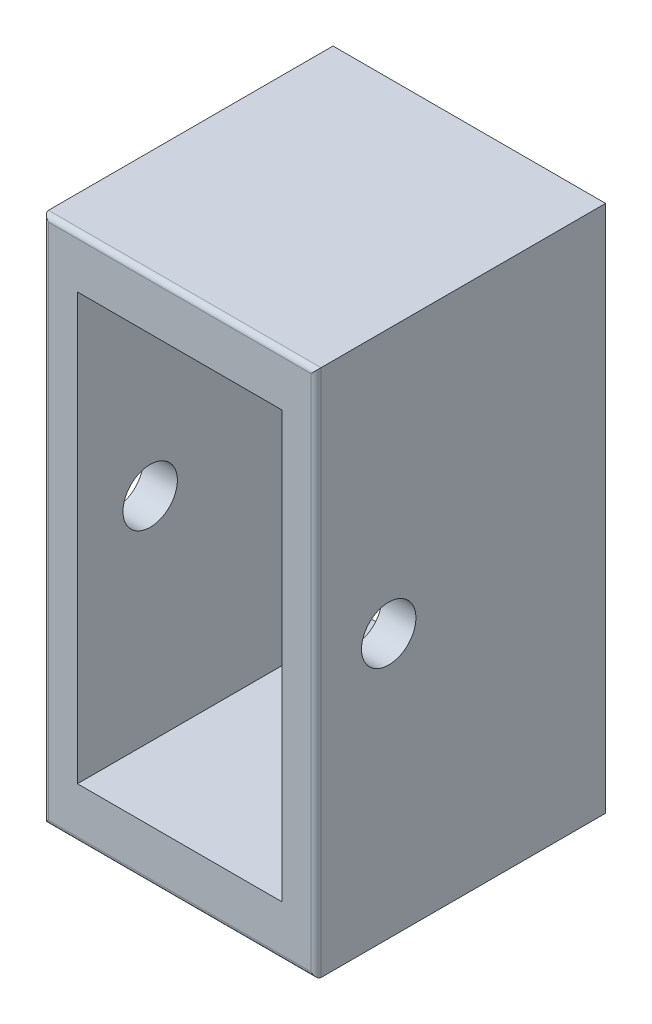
from build123d import *

# Parameters (mm, degrees)
ESQUISSE1_W             = 16
ESQUISSE1_H             = 31
ESQUISSE1_W_2           = 12
ESQUISSE1_H_2           = 25
EXTRUSION1_DEPTH        = 17
CONG_1_R                = 0.3
ESQUISSE2_R             = 1.597713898
ENL_V_MAT_EXTRU_1_DEPTH = 39.807215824


with BuildPart() as part:
    # Esquisse1 → Extrusion1 (new body)
    with BuildSketch(Plane.XY):
        with Locations((8, 15.5)):
            Rectangle(ESQUISSE1_W, ESQUISSE1_H)
        with Locations((8, 15.5)):
            Rectangle(ESQUISSE1_W_2, ESQUISSE1_H_2, mode=Mode.SUBTRACT)
    extrude(amount=EXTRUSION1_DEPTH)

    # Cong_1
    cong_1_edges = [part.edges().sort_by_distance(p)[0] for p in [
        (16, 15.5, 17),
        (8, 31, 17),
        (0, 15.5, 17),
        (8, 0, 17),
    ]]
    fillet(cong_1_edges, radius=CONG_1_R)

    # Esquisse2 → Enl_v. mat.-Extru.1 (cut, through all)
    with BuildSketch(Plane(origin=(16, 0, 0), x_dir=(0, 0, -1), z_dir=(1, 0, 0))):
        with Locations((-12.731956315, 15.5)):
            Circle(ESQUISSE2_R)
    extrude(amount=-ENL_V_MAT_EXTRU_1_DEPTH, mode=Mode.SUBTRACT)


solid = part.part
